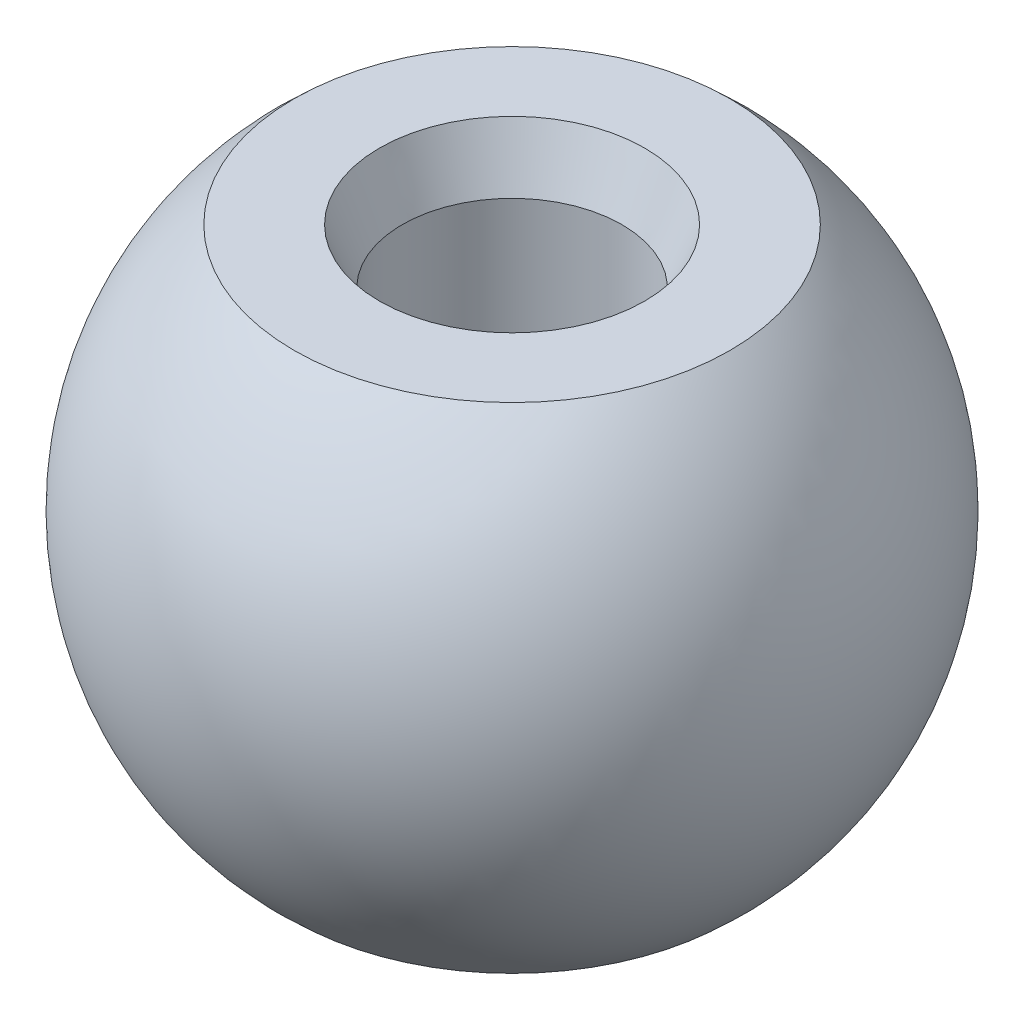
ISO-10303-21;
HEADER;
FILE_DESCRIPTION(('STEP AP214'),'2;1');
FILE_NAME('part.step','',(''),(''),'','','');
FILE_SCHEMA(('AUTOMOTIVE_DESIGN { 1 0 10303 214 1 1 1 1 }'));
ENDSEC;
DATA;
#1=APPLICATION_CONTEXT('core data for automotive mechanical design processes');
#2=APPLICATION_PROTOCOL_DEFINITION('international standard','automotive_design',2000,#1);
#3=PRODUCT_CONTEXT('',#1,'mechanical');
#4=PRODUCT('Part','Part','',(#3));
#5=PRODUCT_RELATED_PRODUCT_CATEGORY('part','',(#4));
#6=PRODUCT_DEFINITION_FORMATION('','',#4);
#7=PRODUCT_DEFINITION_CONTEXT('part definition',#1,'design');
#8=PRODUCT_DEFINITION('design','',#6,#7);
#9=PRODUCT_DEFINITION_SHAPE('','',#8);
#10=(LENGTH_UNIT() NAMED_UNIT(*) SI_UNIT(.MILLI.,.METRE.));
#11=(NAMED_UNIT(*) PLANE_ANGLE_UNIT() SI_UNIT($,.RADIAN.));
#12=(NAMED_UNIT(*) SI_UNIT($,.STERADIAN.) SOLID_ANGLE_UNIT());
#13=UNCERTAINTY_MEASURE_WITH_UNIT(LENGTH_MEASURE(1.E-05),#10,'distance_accuracy_value','');
#14=(GEOMETRIC_REPRESENTATION_CONTEXT(3) GLOBAL_UNCERTAINTY_ASSIGNED_CONTEXT((#13)) GLOBAL_UNIT_ASSIGNED_CONTEXT((#10,
#11,#12)) REPRESENTATION_CONTEXT('',''));
#15=CARTESIAN_POINT('',(0.,0.,0.));
#16=DIRECTION('',(0.,0.,1.));
#17=DIRECTION('',(1.,0.,0.));
#18=AXIS2_PLACEMENT_3D('',#15,#16,#17);
#19=CARTESIAN_POINT('',(6.,4.5,-6.));
#20=DIRECTION('',(0.,1.,0.));
#21=DIRECTION('',(0.,0.,1.));
#22=AXIS2_PLACEMENT_3D('',#19,#20,#21);
#23=PLANE('',#22);
#24=CARTESIAN_POINT('',(0.,4.5,0.));
#25=DIRECTION('',(0.,1.,0.));
#26=DIRECTION('',(0.,0.,1.));
#27=AXIS2_PLACEMENT_3D('',#24,#25,#26);
#28=CIRCLE('',#27,3.96862696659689);
#29=CARTESIAN_POINT('',(0.,4.5,3.96862696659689));
#30=VERTEX_POINT('',#29);
#31=EDGE_CURVE('E10',#30,#30,#28,.F.);
#32=ORIENTED_EDGE('',*,*,#31,.F.);
#33=EDGE_LOOP('',(#32));
#34=FACE_BOUND('',#33,.T.);
#35=CARTESIAN_POINT('',(0.,4.5,0.));
#36=DIRECTION('',(0.,-1.,0.));
#37=DIRECTION('',(0.,0.,-1.));
#38=AXIS2_PLACEMENT_3D('',#35,#36,#37);
#39=CIRCLE('',#38,2.4142135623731);
#40=CARTESIAN_POINT('',(0.,4.5,-2.4142135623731));
#41=VERTEX_POINT('',#40);
#42=EDGE_CURVE('E47',#41,#41,#39,.T.);
#43=ORIENTED_EDGE('',*,*,#42,.T.);
#44=EDGE_LOOP('',(#43));
#45=FACE_BOUND('',#44,.T.);
#46=ADVANCED_FACE('F29',(#34,#45),#23,.T.);
#47=CARTESIAN_POINT('',(6.,-4.5,-6.));
#48=DIRECTION('',(0.,-1.,0.));
#49=DIRECTION('',(0.,0.,1.));
#50=AXIS2_PLACEMENT_3D('',#47,#48,#49);
#51=PLANE('',#50);
#52=CARTESIAN_POINT('',(0.,-4.5,0.));
#53=DIRECTION('',(0.,-1.,0.));
#54=DIRECTION('',(0.,0.,-1.));
#55=AXIS2_PLACEMENT_3D('',#52,#53,#54);
#56=CIRCLE('',#55,3.96862696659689);
#57=CARTESIAN_POINT('',(0.,-4.5,-3.96862696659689));
#58=VERTEX_POINT('',#57);
#59=EDGE_CURVE('E33',#58,#58,#56,.F.);
#60=ORIENTED_EDGE('',*,*,#59,.F.);
#61=EDGE_LOOP('',(#60));
#62=FACE_BOUND('',#61,.T.);
#63=CARTESIAN_POINT('',(0.,-4.5,0.));
#64=DIRECTION('',(0.,-1.,0.));
#65=DIRECTION('',(0.,0.,-1.));
#66=AXIS2_PLACEMENT_3D('',#63,#64,#65);
#67=CIRCLE('',#66,2.);
#68=CARTESIAN_POINT('',(0.,-4.5,-2.));
#69=VERTEX_POINT('',#68);
#70=EDGE_CURVE('E40',#69,#69,#67,.T.);
#71=ORIENTED_EDGE('',*,*,#70,.F.);
#72=EDGE_LOOP('',(#71));
#73=FACE_BOUND('',#72,.T.);
#74=ADVANCED_FACE('F63',(#62,#73),#51,.T.);
#75=CARTESIAN_POINT('',(0.,0.,0.));
#76=DIRECTION('',(0.,0.,-1.));
#77=DIRECTION('',(1.,0.,0.));
#78=AXIS2_PLACEMENT_3D('',#75,#76,#77);
#79=SPHERICAL_SURFACE('',#78,6.);
#80=CARTESIAN_POINT('',(0.,0.,0.));
#81=DIRECTION('',(0.,1.,0.));
#82=DIRECTION('',(0.,0.,1.));
#83=AXIS2_PLACEMENT_3D('',#80,#81,#82);
#84=SPHERICAL_SURFACE('',#83,6.);
#85=ORIENTED_EDGE('',*,*,#31,.T.);
#86=EDGE_LOOP('',(#85));
#87=FACE_BOUND('',#86,.T.);
#88=ORIENTED_EDGE('',*,*,#59,.T.);
#89=EDGE_LOOP('',(#88));
#90=FACE_BOUND('',#89,.T.);
#91=ADVANCED_FACE('F31',(#87,#90),#84,.T.);
#92=CARTESIAN_POINT('',(0.,-4.5,0.));
#93=DIRECTION('',(0.,-1.,0.));
#94=DIRECTION('',(0.,0.,-1.));
#95=AXIS2_PLACEMENT_3D('',#92,#93,#94);
#96=CYLINDRICAL_SURFACE('',#95,2.);
#97=ORIENTED_EDGE('',*,*,#70,.T.);
#98=EDGE_LOOP('',(#97));
#99=FACE_BOUND('',#98,.T.);
#100=CARTESIAN_POINT('',(0.,3.5,0.));
#101=DIRECTION('',(0.,-1.,0.));
#102=DIRECTION('',(0.,0.,-1.));
#103=AXIS2_PLACEMENT_3D('',#100,#101,#102);
#104=CIRCLE('',#103,2.);
#105=CARTESIAN_POINT('',(0.,3.5,-2.));
#106=VERTEX_POINT('',#105);
#107=EDGE_CURVE('E44',#106,#106,#104,.T.);
#108=ORIENTED_EDGE('',*,*,#107,.F.);
#109=EDGE_LOOP('',(#108));
#110=FACE_BOUND('',#109,.T.);
#111=ADVANCED_FACE('F54',(#99,#110),#96,.F.);
#112=CARTESIAN_POINT('',(0.,4.5,0.));
#113=DIRECTION('',(0.,1.,0.));
#114=DIRECTION('',(0.,0.,1.));
#115=AXIS2_PLACEMENT_3D('',#112,#113,#114);
#116=CONICAL_SURFACE('',#115,2.4142135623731,0.392699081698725);
#117=ORIENTED_EDGE('',*,*,#107,.T.);
#118=EDGE_LOOP('',(#117));
#119=FACE_BOUND('',#118,.T.);
#120=ORIENTED_EDGE('',*,*,#42,.F.);
#121=EDGE_LOOP('',(#120));
#122=FACE_BOUND('',#121,.T.);
#123=ADVANCED_FACE('F52',(#119,#122),#116,.F.);
#124=CLOSED_SHELL('',(#46,#74,#91,#111,#123));
#125=MANIFOLD_SOLID_BREP('B2',#124);
#126=ADVANCED_BREP_SHAPE_REPRESENTATION('',(#18,#125),#14);
#127=SHAPE_DEFINITION_REPRESENTATION(#9,#126);
ENDSEC;
END-ISO-10303-21;
